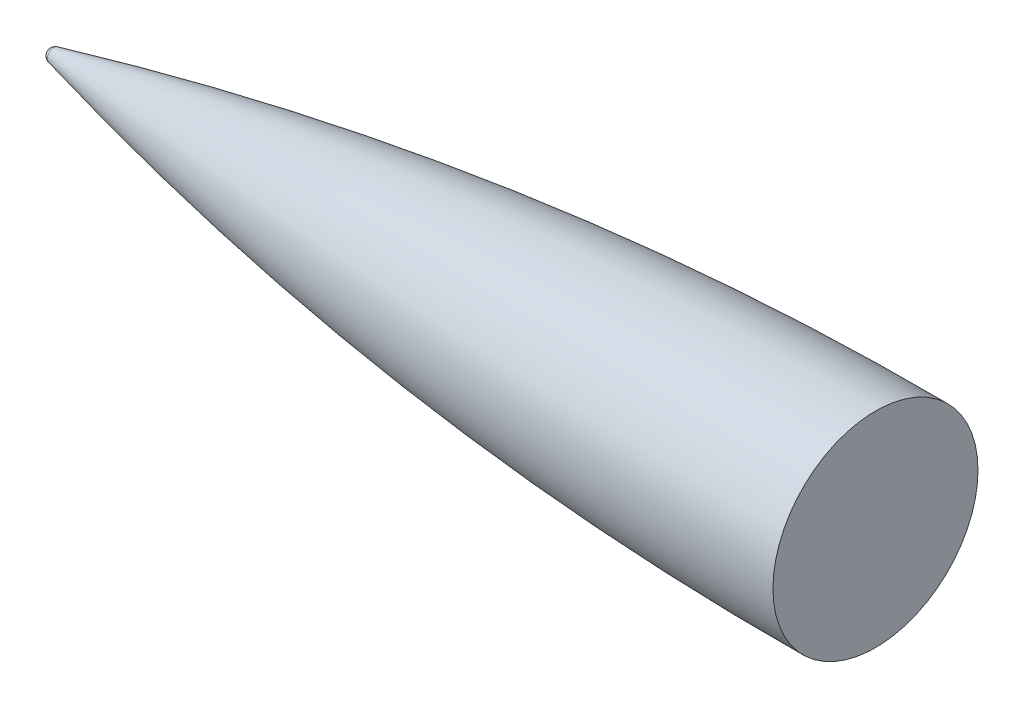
from build123d import *


with BuildPart() as part:
    # Sketch1 → Revolve1 (revolve)
    with BuildSketch(Plane.XY, mode=Mode.PRIVATE) as revolve1_sk:
        with BuildLine():
            Line((325.525034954, 0), (325.525034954, 39.37))
            ThreePointArc((325.525034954, 39.37), (166.61365154, 30.589847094), (9.964123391, 2.467894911))
            ThreePointArc((9.964123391, 2.467894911), (8.567797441, 1.569280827), (8.025034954, 0))
            Line((8.025034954, 0), (325.525034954, 0))
        make_face()
    revolve(revolve1_sk.sketch.rotate(Axis((325.525034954, 0, 0), (-1, 0, 0)), 90), axis=Axis((325.525034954, 0, 0), (-1, 0, 0)))


solid = part.part
